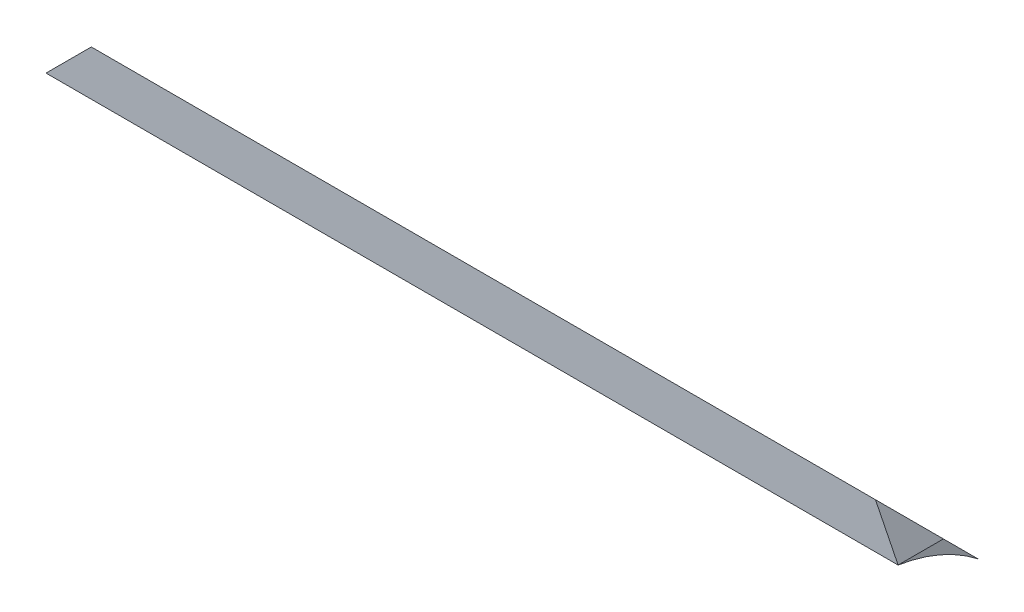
ISO-10303-21;
HEADER;
FILE_DESCRIPTION(('STEP AP214'),'2;1');
FILE_NAME('part.step','',(''),(''),'','','');
FILE_SCHEMA(('AUTOMOTIVE_DESIGN { 1 0 10303 214 1 1 1 1 }'));
ENDSEC;
DATA;
#1=APPLICATION_CONTEXT('core data for automotive mechanical design processes');
#2=APPLICATION_PROTOCOL_DEFINITION('international standard','automotive_design',2000,#1);
#3=PRODUCT_CONTEXT('',#1,'mechanical');
#4=PRODUCT('Part','Part','',(#3));
#5=PRODUCT_RELATED_PRODUCT_CATEGORY('part','',(#4));
#6=PRODUCT_DEFINITION_FORMATION('','',#4);
#7=PRODUCT_DEFINITION_CONTEXT('part definition',#1,'design');
#8=PRODUCT_DEFINITION('design','',#6,#7);
#9=PRODUCT_DEFINITION_SHAPE('','',#8);
#10=(LENGTH_UNIT() NAMED_UNIT(*) SI_UNIT(.MILLI.,.METRE.));
#11=(NAMED_UNIT(*) PLANE_ANGLE_UNIT() SI_UNIT($,.RADIAN.));
#12=(NAMED_UNIT(*) SI_UNIT($,.STERADIAN.) SOLID_ANGLE_UNIT());
#13=UNCERTAINTY_MEASURE_WITH_UNIT(LENGTH_MEASURE(1.E-05),#10,'distance_accuracy_value','');
#14=(GEOMETRIC_REPRESENTATION_CONTEXT(3) GLOBAL_UNCERTAINTY_ASSIGNED_CONTEXT((#13)) GLOBAL_UNIT_ASSIGNED_CONTEXT((#10,
#11,#12)) REPRESENTATION_CONTEXT('',''));
#15=CARTESIAN_POINT('',(0.,0.,0.));
#16=DIRECTION('',(0.,0.,1.));
#17=DIRECTION('',(1.,0.,0.));
#18=AXIS2_PLACEMENT_3D('',#15,#16,#17);
#19=CARTESIAN_POINT('',(0.,12.7,0.));
#20=DIRECTION('',(1.,0.,0.));
#21=DIRECTION('',(0.,0.,-1.));
#22=AXIS2_PLACEMENT_3D('',#19,#20,#21);
#23=PLANE('',#22);
#24=DIRECTION('',(0.,0.,1.));
#25=VECTOR('',#24,1.);
#26=CARTESIAN_POINT('',(0.,4.12477237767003,-12.7));
#27=LINE('',#26,#25);
#28=CARTESIAN_POINT('',(0.,4.12477237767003,-8.57522762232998));
#29=VERTEX_POINT('',#28);
#30=CARTESIAN_POINT('',(0.,4.12477237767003,-3.175));
#31=VERTEX_POINT('',#30);
#32=EDGE_CURVE('E77',#29,#31,#27,.T.);
#33=ORIENTED_EDGE('',*,*,#32,.F.);
#34=DIRECTION('',(0.,-0.707106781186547,-0.707106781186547));
#35=VECTOR('',#34,1.);
#36=CARTESIAN_POINT('',(0.,12.7,0.));
#37=LINE('',#36,#35);
#38=CARTESIAN_POINT('',(0.,0.,-12.7));
#39=VERTEX_POINT('',#38);
#40=EDGE_CURVE('E54',#29,#39,#37,.T.);
#41=ORIENTED_EDGE('',*,*,#40,.T.);
#42=CARTESIAN_POINT('',(0.,-16.2670343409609,0.));
#43=DIRECTION('',(1.,0.,0.));
#44=DIRECTION('',(0.,0.,-1.));
#45=AXIS2_PLACEMENT_3D('',#42,#43,#44);
#46=CIRCLE('',#45,20.6375);
#47=EDGE_CURVE('E97',#39,#31,#46,.T.);
#48=ORIENTED_EDGE('',*,*,#47,.T.);
#49=EDGE_LOOP('',(#33,#41,#48));
#50=FACE_BOUND('',#49,.T.);
#51=ADVANCED_FACE('F32',(#50),#23,.F.);
#52=CARTESIAN_POINT('',(101.6,12.7,0.));
#53=DIRECTION('',(-1.,0.,0.));
#54=DIRECTION('',(0.,0.,1.));
#55=AXIS2_PLACEMENT_3D('',#52,#53,#54);
#56=PLANE('',#55);
#57=DIRECTION('',(0.,0.,1.));
#58=VECTOR('',#57,1.);
#59=CARTESIAN_POINT('',(101.6,4.12477237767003,-12.7));
#60=LINE('',#59,#58);
#61=CARTESIAN_POINT('',(101.6,4.12477237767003,-8.57522762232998));
#62=VERTEX_POINT('',#61);
#63=CARTESIAN_POINT('',(101.6,4.12477237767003,-3.175));
#64=VERTEX_POINT('',#63);
#65=EDGE_CURVE('E71',#62,#64,#60,.T.);
#66=ORIENTED_EDGE('',*,*,#65,.T.);
#67=CARTESIAN_POINT('',(101.6,-16.2670343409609,0.));
#68=DIRECTION('',(1.,0.,0.));
#69=DIRECTION('',(0.,0.,-1.));
#70=AXIS2_PLACEMENT_3D('',#67,#68,#69);
#71=CIRCLE('',#70,20.6375);
#72=CARTESIAN_POINT('',(101.6,0.,-12.7));
#73=VERTEX_POINT('',#72);
#74=EDGE_CURVE('E91',#73,#64,#71,.T.);
#75=ORIENTED_EDGE('',*,*,#74,.F.);
#76=DIRECTION('',(0.,-0.707106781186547,-0.707106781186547));
#77=VECTOR('',#76,1.);
#78=CARTESIAN_POINT('',(101.6,12.7,0.));
#79=LINE('',#78,#77);
#80=EDGE_CURVE('E84',#62,#73,#79,.T.);
#81=ORIENTED_EDGE('',*,*,#80,.F.);
#82=EDGE_LOOP('',(#66,#75,#81));
#83=FACE_BOUND('',#82,.T.);
#84=ADVANCED_FACE('F90',(#83),#56,.F.);
#85=CARTESIAN_POINT('',(0.,12.7,0.));
#86=DIRECTION('',(0.,-0.707106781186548,0.707106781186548));
#87=DIRECTION('',(0.,-0.707106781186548,-0.707106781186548));
#88=AXIS2_PLACEMENT_3D('',#85,#86,#87);
#89=PLANE('',#88);
#90=DIRECTION('',(-0.577350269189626,-0.577350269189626,-0.577350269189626));
#91=VECTOR('',#90,1.);
#92=CARTESIAN_POINT('',(5.71681841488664,9.84159079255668,-2.85840920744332));
#93=LINE('',#92,#91);
#94=CARTESIAN_POINT('',(5.40022762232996,9.525,-3.175));
#95=VERTEX_POINT('',#94);
#96=EDGE_CURVE('E88',#95,#29,#93,.T.);
#97=ORIENTED_EDGE('',*,*,#96,.F.);
#98=DIRECTION('',(1.,0.,0.));
#99=VECTOR('',#98,1.);
#100=CARTESIAN_POINT('',(0.,9.525,-3.175));
#101=LINE('',#100,#99);
#102=CARTESIAN_POINT('',(98.899886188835,9.525,-3.175));
#103=VERTEX_POINT('',#102);
#104=EDGE_CURVE('E87',#95,#103,#101,.T.);
#105=ORIENTED_EDGE('',*,*,#104,.T.);
#106=DIRECTION('',(-0.333333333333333,0.666666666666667,0.666666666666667));
#107=VECTOR('',#106,1.);
#108=CARTESIAN_POINT('',(86.49989883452,34.32497470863,21.62497470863));
#109=LINE('',#108,#107);
#110=EDGE_CURVE('E46',#62,#103,#109,.T.);
#111=ORIENTED_EDGE('',*,*,#110,.F.);
#112=ORIENTED_EDGE('',*,*,#80,.T.);
#113=DIRECTION('',(-1.,0.,0.));
#114=VECTOR('',#113,1.);
#115=CARTESIAN_POINT('',(0.,0.,-12.7));
#116=LINE('',#115,#114);
#117=EDGE_CURVE('E94',#73,#39,#116,.T.);
#118=ORIENTED_EDGE('',*,*,#117,.T.);
#119=ORIENTED_EDGE('',*,*,#40,.F.);
#120=EDGE_LOOP('',(#97,#105,#111,#112,#118,#119));
#121=FACE_BOUND('',#120,.T.);
#122=ADVANCED_FACE('F82',(#121),#89,.F.);
#123=CARTESIAN_POINT('',(0.,22.1081044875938,-3.175));
#124=DIRECTION('',(0.,0.,-1.));
#125=DIRECTION('',(0.,1.,0.));
#126=AXIS2_PLACEMENT_3D('',#123,#124,#125);
#127=PLANE('',#126);
#128=DIRECTION('',(0.707106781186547,0.707106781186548,0.));
#129=VECTOR('',#128,1.);
#130=CARTESIAN_POINT('',(8.99166605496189,13.1164384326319,-3.175));
#131=LINE('',#130,#129);
#132=EDGE_CURVE('E12',#31,#95,#131,.T.);
#133=ORIENTED_EDGE('',*,*,#132,.F.);
#134=DIRECTION('',(1.,0.,0.));
#135=VECTOR('',#134,1.);
#136=CARTESIAN_POINT('',(0.,4.12477237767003,-3.175));
#137=LINE('',#136,#135);
#138=EDGE_CURVE('E92',#31,#64,#137,.T.);
#139=ORIENTED_EDGE('',*,*,#138,.T.);
#140=DIRECTION('',(0.447213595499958,-0.894427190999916,0.));
#141=VECTOR('',#140,1.);
#142=CARTESIAN_POINT('',(74.0866671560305,59.1514380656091,-3.17499999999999));
#143=LINE('',#142,#141);
#144=EDGE_CURVE('E39',#103,#64,#143,.T.);
#145=ORIENTED_EDGE('',*,*,#144,.F.);
#146=ORIENTED_EDGE('',*,*,#104,.F.);
#147=EDGE_LOOP('',(#133,#139,#145,#146));
#148=FACE_BOUND('',#147,.T.);
#149=ADVANCED_FACE('F112',(#148),#127,.F.);
#150=CARTESIAN_POINT('',(0.,-16.2670343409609,0.));
#151=DIRECTION('',(1.,0.,0.));
#152=DIRECTION('',(0.,0.,-1.));
#153=AXIS2_PLACEMENT_3D('',#150,#151,#152);
#154=CYLINDRICAL_SURFACE('',#153,20.6375);
#155=ORIENTED_EDGE('',*,*,#74,.T.);
#156=ORIENTED_EDGE('',*,*,#138,.F.);
#157=ORIENTED_EDGE('',*,*,#47,.F.);
#158=ORIENTED_EDGE('',*,*,#117,.F.);
#159=EDGE_LOOP('',(#155,#156,#157,#158));
#160=FACE_BOUND('',#159,.T.);
#161=ADVANCED_FACE('F103',(#160),#154,.F.);
#162=CARTESIAN_POINT('',(101.6,4.12477237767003,-12.7));
#163=DIRECTION('',(0.894427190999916,0.447213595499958,0.));
#164=DIRECTION('',(-0.447213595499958,0.894427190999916,0.));
#165=AXIS2_PLACEMENT_3D('',#162,#163,#164);
#166=PLANE('',#165);
#167=ORIENTED_EDGE('',*,*,#110,.T.);
#168=ORIENTED_EDGE('',*,*,#144,.T.);
#169=ORIENTED_EDGE('',*,*,#65,.F.);
#170=EDGE_LOOP('',(#167,#168,#169));
#171=FACE_BOUND('',#170,.T.);
#172=ADVANCED_FACE('F72',(#171),#166,.T.);
#173=CARTESIAN_POINT('',(50.8,54.92477237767,-12.7));
#174=DIRECTION('',(-0.707106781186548,0.707106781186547,0.));
#175=DIRECTION('',(-0.707106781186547,-0.707106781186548,0.));
#176=AXIS2_PLACEMENT_3D('',#173,#174,#175);
#177=PLANE('',#176);
#178=ORIENTED_EDGE('',*,*,#96,.T.);
#179=ORIENTED_EDGE('',*,*,#32,.T.);
#180=ORIENTED_EDGE('',*,*,#132,.T.);
#181=EDGE_LOOP('',(#178,#179,#180));
#182=FACE_BOUND('',#181,.T.);
#183=ADVANCED_FACE('F110',(#182),#177,.T.);
#184=CLOSED_SHELL('',(#51,#84,#122,#149,#161,#172,#183));
#185=MANIFOLD_SOLID_BREP('B2',#184);
#186=ADVANCED_BREP_SHAPE_REPRESENTATION('',(#18,#185),#14);
#187=SHAPE_DEFINITION_REPRESENTATION(#9,#186);
ENDSEC;
END-ISO-10303-21;
